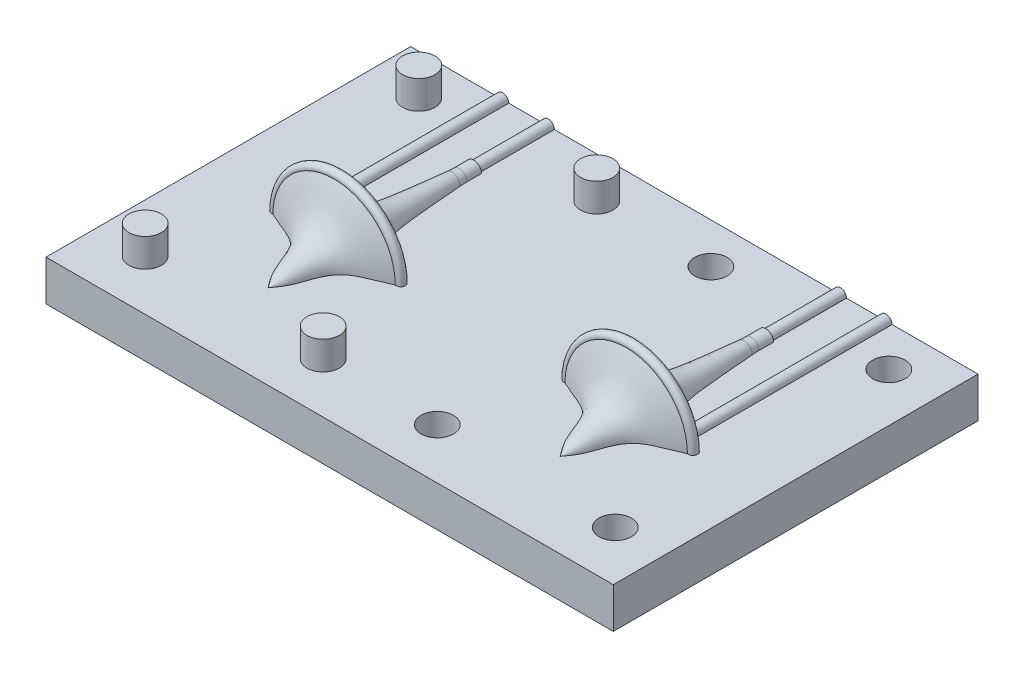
ISO-10303-21;
HEADER;
FILE_DESCRIPTION(('STEP AP214'),'2;1');
FILE_NAME('part.step','',(''),(''),'','','');
FILE_SCHEMA(('AUTOMOTIVE_DESIGN { 1 0 10303 214 1 1 1 1 }'));
ENDSEC;
DATA;
#1=APPLICATION_CONTEXT('core data for automotive mechanical design processes');
#2=APPLICATION_PROTOCOL_DEFINITION('international standard','automotive_design',2000,#1);
#3=PRODUCT_CONTEXT('',#1,'mechanical');
#4=PRODUCT('Part','Part','',(#3));
#5=PRODUCT_RELATED_PRODUCT_CATEGORY('part','',(#4));
#6=PRODUCT_DEFINITION_FORMATION('','',#4);
#7=PRODUCT_DEFINITION_CONTEXT('part definition',#1,'design');
#8=PRODUCT_DEFINITION('design','',#6,#7);
#9=PRODUCT_DEFINITION_SHAPE('','',#8);
#10=(LENGTH_UNIT() NAMED_UNIT(*) SI_UNIT(.MILLI.,.METRE.));
#11=(NAMED_UNIT(*) PLANE_ANGLE_UNIT() SI_UNIT($,.RADIAN.));
#12=(NAMED_UNIT(*) SI_UNIT($,.STERADIAN.) SOLID_ANGLE_UNIT());
#13=UNCERTAINTY_MEASURE_WITH_UNIT(LENGTH_MEASURE(1.E-05),#10,'distance_accuracy_value','');
#14=(GEOMETRIC_REPRESENTATION_CONTEXT(3) GLOBAL_UNCERTAINTY_ASSIGNED_CONTEXT((#13)) GLOBAL_UNIT_ASSIGNED_CONTEXT((#10,
#11,#12)) REPRESENTATION_CONTEXT('',''));
#15=CARTESIAN_POINT('',(0.,0.,0.));
#16=DIRECTION('',(0.,0.,1.));
#17=DIRECTION('',(1.,0.,0.));
#18=AXIS2_PLACEMENT_3D('',#15,#16,#17);
#19=CARTESIAN_POINT('',(0.,0.,0.));
#20=DIRECTION('',(0.,1.,0.));
#21=DIRECTION('',(0.,0.,1.));
#22=AXIS2_PLACEMENT_3D('',#19,#20,#21);
#23=PLANE('',#22);
#24=CARTESIAN_POINT('',(36.7814315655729,-1.05520616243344E-13,6.45827597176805));
#25=CARTESIAN_POINT('',(24.755098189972,0.,2.45774370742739));
#26=CARTESIAN_POINT('',(25.6676785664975,0.,2.40279251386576));
#27=CARTESIAN_POINT('',(23.6545891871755,0.,-20.4964687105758));
#28=B_SPLINE_CURVE_WITH_KNOTS('',3,(#24,#25,#26,#27),.UNSPECIFIED.,.F.,.F.,(4,4),(0.,1.),.UNSPECIFIED.);
#29=CARTESIAN_POINT('',(31.426362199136,0.,4.51387207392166));
#30=VERTEX_POINT('',#29);
#31=CARTESIAN_POINT('',(23.6545891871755,0.,-20.4964687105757));
#32=VERTEX_POINT('',#31);
#33=EDGE_CURVE('E204',#30,#32,#28,.T.);
#34=ORIENTED_EDGE('',*,*,#33,.F.);
#35=DIRECTION('',(0.,0.,1.));
#36=VECTOR('',#35,1.);
#37=CARTESIAN_POINT('',(31.4263621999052,0.,5.66200099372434));
#38=LINE('',#37,#36);
#39=CARTESIAN_POINT('',(31.4263621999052,0.,-44.2476631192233));
#40=VERTEX_POINT('',#39);
#41=EDGE_CURVE('E55',#40,#30,#38,.T.);
#42=ORIENTED_EDGE('',*,*,#41,.F.);
#43=DIRECTION('',(-1.,0.,0.));
#44=VECTOR('',#43,1.);
#45=CARTESIAN_POINT('',(-84.3695700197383,0.,-44.2476631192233));
#46=LINE('',#45,#44);
#47=CARTESIAN_POINT('',(23.1702787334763,0.,-44.2476631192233));
#48=VERTEX_POINT('',#47);
#49=EDGE_CURVE('E418',#40,#48,#46,.T.);
#50=ORIENTED_EDGE('',*,*,#49,.T.);
#51=DIRECTION('',(0.,0.,-1.));
#52=VECTOR('',#51,1.);
#53=CARTESIAN_POINT('',(23.1702787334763,0.,-25.8649161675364));
#54=LINE('',#53,#52);
#55=CARTESIAN_POINT('',(23.1702787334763,0.,-25.8649161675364));
#56=VERTEX_POINT('',#55);
#57=EDGE_CURVE('E625',#56,#48,#54,.T.);
#58=ORIENTED_EDGE('',*,*,#57,.F.);
#59=DIRECTION('',(-1.,0.,0.));
#60=VECTOR('',#59,1.);
#61=CARTESIAN_POINT('',(23.5777514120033,0.,-25.8649161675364));
#62=LINE('',#61,#60);
#63=CARTESIAN_POINT('',(23.5777514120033,0.,-25.8649161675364));
#64=VERTEX_POINT('',#63);
#65=EDGE_CURVE('E305',#64,#56,#62,.T.);
#66=ORIENTED_EDGE('',*,*,#65,.F.);
#67=DIRECTION('',(0.,0.,-1.));
#68=VECTOR('',#67,1.);
#69=CARTESIAN_POINT('',(23.5777514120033,0.,-22.2479272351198));
#70=LINE('',#69,#68);
#71=CARTESIAN_POINT('',(23.5777514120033,0.,-22.2479272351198));
#72=VERTEX_POINT('',#71);
#73=EDGE_CURVE('E302',#72,#64,#70,.T.);
#74=ORIENTED_EDGE('',*,*,#73,.F.);
#75=CARTESIAN_POINT('',(43.5777514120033,-1.52979064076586E-13,-22.2479272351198));
#76=DIRECTION('',(0.,-1.,0.));
#77=DIRECTION('',(0.,0.,-1.));
#78=AXIS2_PLACEMENT_3D('',#75,#76,#77);
#79=CIRCLE('',#78,20.);
#80=EDGE_CURVE('E203',#32,#72,#79,.T.);
#81=ORIENTED_EDGE('',*,*,#80,.F.);
#82=EDGE_LOOP('',(#34,#42,#50,#58,#66,#74,#81));
#83=FACE_BOUND('',#82,.T.);
#84=ADVANCED_FACE('F35',(#83),#23,.T.);
#85=CARTESIAN_POINT('',(-0.289872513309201,0.,-34.2476631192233));
#86=DIRECTION('',(0.,1.,0.));
#87=DIRECTION('',(0.,0.,-1.));
#88=AXIS2_PLACEMENT_3D('',#85,#86,#87);
#89=CIRCLE('',#88,4.);
#90=CARTESIAN_POINT('',(-0.289872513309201,0.,-38.2476631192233));
#91=VERTEX_POINT('',#90);
#92=EDGE_CURVE('E613',#91,#91,#89,.T.);
#93=ORIENTED_EDGE('',*,*,#92,.F.);
#94=EDGE_LOOP('',(#93));
#95=FACE_BOUND('',#94,.T.);
#96=CARTESIAN_POINT('',(-0.289872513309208,0.,33.2762317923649));
#97=DIRECTION('',(0.,1.,0.));
#98=DIRECTION('',(0.,0.,-1.));
#99=AXIS2_PLACEMENT_3D('',#96,#97,#98);
#100=CIRCLE('',#99,4.);
#101=CARTESIAN_POINT('',(-0.289872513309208,0.,29.2762317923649));
#102=VERTEX_POINT('',#101);
#103=EDGE_CURVE('E607',#102,#102,#100,.T.);
#104=ORIENTED_EDGE('',*,*,#103,.F.);
#105=EDGE_LOOP('',(#104));
#106=FACE_BOUND('',#105,.T.);
#107=CARTESIAN_POINT('',(43.6304299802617,0.,33.2762317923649));
#108=DIRECTION('',(0.,1.,0.));
#109=DIRECTION('',(0.,0.,-1.));
#110=AXIS2_PLACEMENT_3D('',#107,#108,#109);
#111=CIRCLE('',#110,4.00000000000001);
#112=CARTESIAN_POINT('',(43.6304299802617,0.,29.2762317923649));
#113=VERTEX_POINT('',#112);
#114=EDGE_CURVE('E600',#113,#113,#111,.T.);
#115=ORIENTED_EDGE('',*,*,#114,.F.);
#116=EDGE_LOOP('',(#115));
#117=FACE_BOUND('',#116,.T.);
#118=CARTESIAN_POINT('',(43.6304299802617,0.,-34.2476631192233));
#119=DIRECTION('',(0.,1.,0.));
#120=DIRECTION('',(0.,0.,-1.));
#121=AXIS2_PLACEMENT_3D('',#118,#119,#120);
#122=CIRCLE('',#121,4.00000000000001);
#123=CARTESIAN_POINT('',(43.6304299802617,0.,-38.2476631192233));
#124=VERTEX_POINT('',#123);
#125=EDGE_CURVE('E591',#124,#124,#122,.T.);
#126=ORIENTED_EDGE('',*,*,#125,.F.);
#127=EDGE_LOOP('',(#126));
#128=FACE_BOUND('',#127,.T.);
#129=CARTESIAN_POINT('',(-28.4492675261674,0.,33.2762317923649));
#130=DIRECTION('',(0.,1.,0.));
#131=DIRECTION('',(0.,0.,1.));
#132=AXIS2_PLACEMENT_3D('',#129,#130,#131);
#133=CIRCLE('',#132,4.);
#134=CARTESIAN_POINT('',(-28.4492675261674,0.,37.276231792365));
#135=VERTEX_POINT('',#134);
#136=EDGE_CURVE('E551',#135,#135,#133,.T.);
#137=ORIENTED_EDGE('',*,*,#136,.F.);
#138=EDGE_LOOP('',(#137));
#139=FACE_BOUND('',#138,.T.);
#140=CARTESIAN_POINT('',(-72.3695700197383,0.,33.276231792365));
#141=DIRECTION('',(0.,1.,0.));
#142=DIRECTION('',(0.,0.,1.));
#143=AXIS2_PLACEMENT_3D('',#140,#141,#142);
#144=CIRCLE('',#143,4.00000000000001);
#145=CARTESIAN_POINT('',(-72.3695700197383,0.,37.276231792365));
#146=VERTEX_POINT('',#145);
#147=EDGE_CURVE('E545',#146,#146,#144,.T.);
#148=ORIENTED_EDGE('',*,*,#147,.F.);
#149=EDGE_LOOP('',(#148));
#150=FACE_BOUND('',#149,.T.);
#151=CARTESIAN_POINT('',(-28.4492675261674,0.,-34.2476631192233));
#152=DIRECTION('',(0.,1.,0.));
#153=DIRECTION('',(0.,0.,1.));
#154=AXIS2_PLACEMENT_3D('',#151,#152,#153);
#155=CIRCLE('',#154,4.);
#156=CARTESIAN_POINT('',(-28.4492675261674,0.,-30.2476631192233));
#157=VERTEX_POINT('',#156);
#158=EDGE_CURVE('E539',#157,#157,#155,.T.);
#159=ORIENTED_EDGE('',*,*,#158,.F.);
#160=EDGE_LOOP('',(#159));
#161=FACE_BOUND('',#160,.T.);
#162=CARTESIAN_POINT('',(-72.3695700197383,0.,-34.2476631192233));
#163=DIRECTION('',(0.,1.,0.));
#164=DIRECTION('',(0.,0.,1.));
#165=AXIS2_PLACEMENT_3D('',#162,#163,#164);
#166=CIRCLE('',#165,4.00000000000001);
#167=CARTESIAN_POINT('',(-72.3695700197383,0.,-30.2476631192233));
#168=VERTEX_POINT('',#167);
#169=EDGE_CURVE('E408',#168,#168,#166,.T.);
#170=ORIENTED_EDGE('',*,*,#169,.F.);
#171=EDGE_LOOP('',(#170));
#172=FACE_BOUND('',#171,.T.);
#173=CARTESIAN_POINT('',(55.6304299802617,0.,-44.2476631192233));
#174=VERTEX_POINT('',#173);
#175=CARTESIAN_POINT('',(34.4263621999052,0.,-44.2476631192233));
#176=VERTEX_POINT('',#175);
#177=EDGE_CURVE('E63',#174,#176,#46,.T.);
#178=ORIENTED_EDGE('',*,*,#177,.T.);
#179=DIRECTION('',(0.,0.,1.));
#180=VECTOR('',#179,1.);
#181=CARTESIAN_POINT('',(34.4263621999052,0.,5.66200099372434));
#182=LINE('',#181,#180);
#183=CARTESIAN_POINT('',(34.4263621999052,0.,5.66200099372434));
#184=VERTEX_POINT('',#183);
#185=EDGE_CURVE('E206',#176,#184,#182,.T.);
#186=ORIENTED_EDGE('',*,*,#185,.T.);
#187=CARTESIAN_POINT('',(36.7814315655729,-1.05520616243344E-13,6.45827597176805));
#188=VERTEX_POINT('',#187);
#189=EDGE_CURVE('E198',#188,#184,#28,.T.);
#190=ORIENTED_EDGE('',*,*,#189,.F.);
#191=CARTESIAN_POINT('',(37.0640182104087,-1.07493908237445E-13,7.53576640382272));
#192=DIRECTION('',(0.,1.,0.));
#193=DIRECTION('',(0.,0.,-1.));
#194=AXIS2_PLACEMENT_3D('',#191,#192,#193);
#195=CIRCLE('',#194,1.11393035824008);
#196=CARTESIAN_POINT('',(36.7814315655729,-1.05520616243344E-13,8.61325683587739));
#197=VERTEX_POINT('',#196);
#198=EDGE_CURVE('E312',#197,#188,#195,.T.);
#199=ORIENTED_EDGE('',*,*,#198,.F.);
#200=CARTESIAN_POINT('',(21.6702787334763,0.,24.8934848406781));
#201=CARTESIAN_POINT('',(25.3778381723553,0.,20.0177586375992));
#202=CARTESIAN_POINT('',(24.303276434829,0.,20.0888211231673));
#203=CARTESIAN_POINT('',(26.4810163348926,0.,10.6163736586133));
#204=CARTESIAN_POINT('',(28.1140289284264,0.,12.7177981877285));
#205=CARTESIAN_POINT('',(36.7814315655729,-1.05520616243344E-13,8.61325683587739));
#206=B_SPLINE_CURVE_WITH_KNOTS('',5,(#200,#201,#202,#203,#204,#205),.UNSPECIFIED.,.F.,.F.,(6,6),
(0.,1.),.UNSPECIFIED.);
#207=CARTESIAN_POINT('',(21.6702787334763,0.,24.8934848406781));
#208=VERTEX_POINT('',#207);
#209=EDGE_CURVE('E307',#208,#197,#206,.T.);
#210=ORIENTED_EDGE('',*,*,#209,.F.);
#211=CARTESIAN_POINT('',(21.6702787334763,0.,24.8934848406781));
#212=CARTESIAN_POINT('',(17.9627192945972,0.,20.0177586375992));
#213=CARTESIAN_POINT('',(19.0372810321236,0.,20.0888211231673));
#214=CARTESIAN_POINT('',(16.8595411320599,0.,10.6163736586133));
#215=CARTESIAN_POINT('',(15.2265285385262,0.,12.7177981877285));
#216=CARTESIAN_POINT('',(6.55912590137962,0.,8.61325683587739));
#217=B_SPLINE_CURVE_WITH_KNOTS('',5,(#211,#212,#213,#214,#215,#216),.UNSPECIFIED.,.F.,.F.,(6,6),
(0.,1.),.UNSPECIFIED.);
#218=CARTESIAN_POINT('',(6.55912590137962,0.,8.61325683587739));
#219=VERTEX_POINT('',#218);
#220=EDGE_CURVE('E572',#208,#219,#217,.T.);
#221=ORIENTED_EDGE('',*,*,#220,.T.);
#222=CARTESIAN_POINT('',(6.2765392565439,0.,7.53576640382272));
#223=DIRECTION('',(0.,-1.,0.));
#224=DIRECTION('',(0.,0.,-1.));
#225=AXIS2_PLACEMENT_3D('',#222,#223,#224);
#226=CIRCLE('',#225,1.11393035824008);
#227=CARTESIAN_POINT('',(6.55912590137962,0.,6.45827597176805));
#228=VERTEX_POINT('',#227);
#229=EDGE_CURVE('E296',#219,#228,#226,.T.);
#230=ORIENTED_EDGE('',*,*,#229,.T.);
#231=CARTESIAN_POINT('',(6.55912590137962,0.,6.45827597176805));
#232=CARTESIAN_POINT('',(18.5854592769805,0.,2.45774370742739));
#233=CARTESIAN_POINT('',(17.6728789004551,0.,2.40279251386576));
#234=CARTESIAN_POINT('',(19.685968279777,0.,-20.4964687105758));
#235=B_SPLINE_CURVE_WITH_KNOTS('',3,(#231,#232,#233,#234),.UNSPECIFIED.,.F.,.F.,(4,4),(0.,1.),.UNSPECIFIED.);
#236=CARTESIAN_POINT('',(19.685968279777,0.,-20.4964687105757));
#237=VERTEX_POINT('',#236);
#238=EDGE_CURVE('E585',#228,#237,#235,.T.);
#239=ORIENTED_EDGE('',*,*,#238,.T.);
#240=CARTESIAN_POINT('',(-0.237193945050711,0.,-22.2479272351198));
#241=DIRECTION('',(0.,1.,0.));
#242=DIRECTION('',(0.,0.,-1.));
#243=AXIS2_PLACEMENT_3D('',#240,#241,#242);
#244=CIRCLE('',#243,20.);
#245=CARTESIAN_POINT('',(19.7628060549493,0.,-22.2479272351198));
#246=VERTEX_POINT('',#245);
#247=EDGE_CURVE('E575',#237,#246,#244,.T.);
#248=ORIENTED_EDGE('',*,*,#247,.T.);
#249=DIRECTION('',(0.,0.,-1.));
#250=VECTOR('',#249,1.);
#251=CARTESIAN_POINT('',(19.7628060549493,0.,-22.2479272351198));
#252=LINE('',#251,#250);
#253=CARTESIAN_POINT('',(19.7628060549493,0.,-25.8649161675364));
#254=VERTEX_POINT('',#253);
#255=EDGE_CURVE('E573',#246,#254,#252,.T.);
#256=ORIENTED_EDGE('',*,*,#255,.T.);
#257=CARTESIAN_POINT('',(20.1702787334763,0.,-25.8649161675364));
#258=VERTEX_POINT('',#257);
#259=EDGE_CURVE('E304',#258,#254,#62,.T.);
#260=ORIENTED_EDGE('',*,*,#259,.F.);
#261=DIRECTION('',(0.,0.,-1.));
#262=VECTOR('',#261,1.);
#263=CARTESIAN_POINT('',(20.1702787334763,0.,-25.8649161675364));
#264=LINE('',#263,#262);
#265=CARTESIAN_POINT('',(20.1702787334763,0.,-44.2476631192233));
#266=VERTEX_POINT('',#265);
#267=EDGE_CURVE('E623',#258,#266,#264,.T.);
#268=ORIENTED_EDGE('',*,*,#267,.T.);
#269=CARTESIAN_POINT('',(-48.9094187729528,0.,-44.2476631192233));
#270=VERTEX_POINT('',#269);
#271=EDGE_CURVE('E419',#266,#270,#46,.T.);
#272=ORIENTED_EDGE('',*,*,#271,.T.);
#273=DIRECTION('',(0.,0.,-1.));
#274=VECTOR('',#273,1.);
#275=CARTESIAN_POINT('',(-48.9094187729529,0.,-25.8649161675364));
#276=LINE('',#275,#274);
#277=CARTESIAN_POINT('',(-48.9094187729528,0.,-25.8649161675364));
#278=VERTEX_POINT('',#277);
#279=EDGE_CURVE('E631',#278,#270,#276,.T.);
#280=ORIENTED_EDGE('',*,*,#279,.F.);
#281=DIRECTION('',(1.,0.,0.));
#282=VECTOR('',#281,1.);
#283=CARTESIAN_POINT('',(-52.3168914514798,0.,-25.8649161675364));
#284=LINE('',#283,#282);
#285=CARTESIAN_POINT('',(-48.5019460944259,0.,-25.8649161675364));
#286=VERTEX_POINT('',#285);
#287=EDGE_CURVE('E466',#278,#286,#284,.T.);
#288=ORIENTED_EDGE('',*,*,#287,.T.);
#289=DIRECTION('',(0.,0.,-1.));
#290=VECTOR('',#289,1.);
#291=CARTESIAN_POINT('',(-48.5019460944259,0.,-22.2479272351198));
#292=LINE('',#291,#290);
#293=CARTESIAN_POINT('',(-48.5019460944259,0.,-22.2479272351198));
#294=VERTEX_POINT('',#293);
#295=EDGE_CURVE('E437',#294,#286,#292,.T.);
#296=ORIENTED_EDGE('',*,*,#295,.F.);
#297=CARTESIAN_POINT('',(-28.5019460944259,0.,-22.2479272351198));
#298=DIRECTION('',(0.,-1.,0.));
#299=DIRECTION('',(0.,0.,-1.));
#300=AXIS2_PLACEMENT_3D('',#297,#298,#299);
#301=CIRCLE('',#300,20.);
#302=CARTESIAN_POINT('',(-48.4251083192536,0.,-20.4964687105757));
#303=VERTEX_POINT('',#302);
#304=EDGE_CURVE('E431',#303,#294,#301,.T.);
#305=ORIENTED_EDGE('',*,*,#304,.F.);
#306=CARTESIAN_POINT('',(-35.2982659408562,0.,6.45827597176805));
#307=CARTESIAN_POINT('',(-47.3245993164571,0.,2.45774370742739));
#308=CARTESIAN_POINT('',(-46.4120189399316,0.,2.40279251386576));
#309=CARTESIAN_POINT('',(-48.4251083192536,0.,-20.4964687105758));
#310=B_SPLINE_CURVE_WITH_KNOTS('',3,(#306,#307,#308,#309),.UNSPECIFIED.,.F.,.F.,(4,4),(0.,1.),.UNSPECIFIED.);
#311=CARTESIAN_POINT('',(-35.2982659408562,0.,6.45827597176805));
#312=VERTEX_POINT('',#311);
#313=EDGE_CURVE('E421',#312,#303,#310,.T.);
#314=ORIENTED_EDGE('',*,*,#313,.F.);
#315=CARTESIAN_POINT('',(-35.0156792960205,0.,7.53576640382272));
#316=DIRECTION('',(0.,1.,0.));
#317=DIRECTION('',(0.,0.,-1.));
#318=AXIS2_PLACEMENT_3D('',#315,#316,#317);
#319=CIRCLE('',#318,1.11393035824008);
#320=CARTESIAN_POINT('',(-35.2982659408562,0.,8.61325683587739));
#321=VERTEX_POINT('',#320);
#322=EDGE_CURVE('E445',#321,#312,#319,.T.);
#323=ORIENTED_EDGE('',*,*,#322,.F.);
#324=CARTESIAN_POINT('',(-50.4094187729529,0.,24.8934848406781));
#325=CARTESIAN_POINT('',(-46.7018593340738,0.,20.0177586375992));
#326=CARTESIAN_POINT('',(-47.7764210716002,0.,20.0888211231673));
#327=CARTESIAN_POINT('',(-45.5986811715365,0.,10.6163736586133));
#328=CARTESIAN_POINT('',(-43.9656685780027,0.,12.7177981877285));
#329=CARTESIAN_POINT('',(-35.2982659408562,0.,8.61325683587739));
#330=B_SPLINE_CURVE_WITH_KNOTS('',5,(#324,#325,#326,#327,#328,#329),.UNSPECIFIED.,.F.,.F.,(6,6),
(0.,1.),.UNSPECIFIED.);
#331=CARTESIAN_POINT('',(-50.4094187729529,0.,24.8934848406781));
#332=VERTEX_POINT('',#331);
#333=EDGE_CURVE('E440',#332,#321,#330,.T.);
#334=ORIENTED_EDGE('',*,*,#333,.F.);
#335=CARTESIAN_POINT('',(-50.4094187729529,0.,24.8934848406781));
#336=CARTESIAN_POINT('',(-54.1169782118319,0.,20.0177586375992));
#337=CARTESIAN_POINT('',(-53.0424164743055,0.,20.0888211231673));
#338=CARTESIAN_POINT('',(-55.2201563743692,0.,10.6163736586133));
#339=CARTESIAN_POINT('',(-56.853168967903,0.,12.7177981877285));
#340=CARTESIAN_POINT('',(-65.5205716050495,-1.05520616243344E-13,8.61325683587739));
#341=B_SPLINE_CURVE_WITH_KNOTS('',5,(#335,#336,#337,#338,#339,#340),.UNSPECIFIED.,.F.,.F.,(6,6),
(0.,1.),.UNSPECIFIED.);
#342=CARTESIAN_POINT('',(-65.5205716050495,-1.05520616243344E-13,8.61325683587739));
#343=VERTEX_POINT('',#342);
#344=EDGE_CURVE('E470',#332,#343,#341,.T.);
#345=ORIENTED_EDGE('',*,*,#344,.T.);
#346=CARTESIAN_POINT('',(-65.8031582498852,-1.07493908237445E-13,7.53576640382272));
#347=DIRECTION('',(0.,-1.,0.));
#348=DIRECTION('',(0.,0.,-1.));
#349=AXIS2_PLACEMENT_3D('',#346,#347,#348);
#350=CIRCLE('',#349,1.11393035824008);
#351=CARTESIAN_POINT('',(-65.5205716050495,0.,6.45827597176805));
#352=VERTEX_POINT('',#351);
#353=EDGE_CURVE('E476',#343,#352,#350,.T.);
#354=ORIENTED_EDGE('',*,*,#353,.T.);
#355=CARTESIAN_POINT('',(-65.5205716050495,-1.05520616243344E-13,6.45827597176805));
#356=CARTESIAN_POINT('',(-53.4942382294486,0.,2.45774370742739));
#357=CARTESIAN_POINT('',(-54.4068186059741,0.,2.40279251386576));
#358=CARTESIAN_POINT('',(-52.3937292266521,0.,-20.4964687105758));
#359=B_SPLINE_CURVE_WITH_KNOTS('',3,(#355,#356,#357,#358),.UNSPECIFIED.,.F.,.F.,(4,4),(0.,1.),.UNSPECIFIED.);
#360=CARTESIAN_POINT('',(-63.1655022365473,0.,5.66200099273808));
#361=VERTEX_POINT('',#360);
#362=EDGE_CURVE('E451',#352,#361,#359,.T.);
#363=ORIENTED_EDGE('',*,*,#362,.T.);
#364=DIRECTION('',(0.,0.,1.));
#365=VECTOR('',#364,1.);
#366=CARTESIAN_POINT('',(-63.1655022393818,0.,5.66200099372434));
#367=LINE('',#366,#365);
#368=CARTESIAN_POINT('',(-63.1655022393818,0.,-44.2476631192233));
#369=VERTEX_POINT('',#368);
#370=EDGE_CURVE('E215',#369,#361,#367,.T.);
#371=ORIENTED_EDGE('',*,*,#370,.F.);
#372=CARTESIAN_POINT('',(-84.3695700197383,0.,-44.2476631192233));
#373=VERTEX_POINT('',#372);
#374=EDGE_CURVE('E415',#369,#373,#46,.T.);
#375=ORIENTED_EDGE('',*,*,#374,.T.);
#376=DIRECTION('',(0.,0.,1.));
#377=VECTOR('',#376,1.);
#378=CARTESIAN_POINT('',(-84.3695700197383,0.,-44.2476631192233));
#379=LINE('',#378,#377);
#380=CARTESIAN_POINT('',(-84.3695700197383,0.,45.7523368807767));
#381=VERTEX_POINT('',#380);
#382=EDGE_CURVE('E394',#373,#381,#379,.T.);
#383=ORIENTED_EDGE('',*,*,#382,.T.);
#384=DIRECTION('',(1.,0.,0.));
#385=VECTOR('',#384,1.);
#386=CARTESIAN_POINT('',(-84.3695700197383,0.,45.7523368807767));
#387=LINE('',#386,#385);
#388=CARTESIAN_POINT('',(55.6304299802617,0.,45.7523368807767));
#389=VERTEX_POINT('',#388);
#390=EDGE_CURVE('E402',#381,#389,#387,.T.);
#391=ORIENTED_EDGE('',*,*,#390,.T.);
#392=DIRECTION('',(0.,0.,-1.));
#393=VECTOR('',#392,1.);
#394=CARTESIAN_POINT('',(55.6304299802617,0.,-44.2476631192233));
#395=LINE('',#394,#393);
#396=EDGE_CURVE('E405',#389,#174,#395,.T.);
#397=ORIENTED_EDGE('',*,*,#396,.T.);
#398=EDGE_LOOP('',(#178,#186,#190,#199,#210,#221,#230,#239,#248,#256,#260,#268,#272,#280,#288,
#296,#305,#314,#323,#334,#345,#354,#363,#371,#375,#383,#391,#397));
#399=FACE_BOUND('',#398,.T.);
#400=ADVANCED_FACE('F207',(#95,#106,#117,#128,#139,#150,#161,#172,#399),#23,.T.);
#401=CARTESIAN_POINT('',(21.6702787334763,0.,33.848795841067));
#402=DIRECTION('',(0.,0.,-1.));
#403=AXIS1_PLACEMENT('',#401,#402);
#404=SURFACE_OF_REVOLUTION('',#28,#403);
#405=CARTESIAN_POINT('',(31.4263621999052,0.,4.51387207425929));
#406=CARTESIAN_POINT('',(31.4263559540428,0.0392249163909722,4.51386692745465));
#407=CARTESIAN_POINT('',(31.4279006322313,0.0784458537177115,4.51465111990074));
#408=CARTESIAN_POINT('',(31.4340436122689,0.156573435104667,4.5177592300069));
#409=CARTESIAN_POINT('',(31.4386408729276,0.195480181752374,4.52008262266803));
#410=CARTESIAN_POINT('',(31.450816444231,0.272545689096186,4.52621792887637));
#411=CARTESIAN_POINT('',(31.4583827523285,0.310706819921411,4.53002384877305));
#412=CARTESIAN_POINT('',(31.4764015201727,0.386161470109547,4.5390494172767));
#413=CARTESIAN_POINT('',(31.4868541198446,0.423454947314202,4.54426913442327));
#414=CARTESIAN_POINT('',(31.5223605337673,0.533582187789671,4.56190855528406));
#415=CARTESIAN_POINT('',(31.5515859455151,0.604805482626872,4.57632034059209));
#416=CARTESIAN_POINT('',(31.6200180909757,0.741149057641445,4.60956231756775));
#417=CARTESIAN_POINT('',(31.6592330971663,0.806264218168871,4.62839617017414));
#418=CARTESIAN_POINT('',(31.7486181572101,0.932301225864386,4.67057847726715));
#419=CARTESIAN_POINT('',(31.7992471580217,0.992836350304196,4.69410902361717));
#420=CARTESIAN_POINT('',(31.9086392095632,1.1047026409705,4.74393273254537));
#421=CARTESIAN_POINT('',(31.9674048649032,1.1560308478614,4.77022677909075));
#422=CARTESIAN_POINT('',(32.0975549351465,1.25310840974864,4.82724641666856));
#423=CARTESIAN_POINT('',(32.1696087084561,1.29785436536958,4.85815531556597));
#424=CARTESIAN_POINT('',(32.3198063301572,1.37448311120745,4.92110545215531));
#425=CARTESIAN_POINT('',(32.3979520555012,1.40636191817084,4.95314703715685));
#426=CARTESIAN_POINT('',(32.5632617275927,1.45811608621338,5.01941623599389));
#427=CARTESIAN_POINT('',(32.6506852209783,1.47714773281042,5.05365873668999));
#428=CARTESIAN_POINT('',(32.8277861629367,1.49941650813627,5.12148306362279));
#429=CARTESIAN_POINT('',(32.9174639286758,1.50265140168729,5.15506479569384));
#430=CARTESIAN_POINT('',(33.0973522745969,1.49296654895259,5.22105658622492));
#431=CARTESIAN_POINT('',(33.1875600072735,1.47989562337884,5.25345277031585));
#432=CARTESIAN_POINT('',(33.3648633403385,1.43736702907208,5.31596372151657));
#433=CARTESIAN_POINT('',(33.4519593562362,1.407911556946,5.34607879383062));
#434=CARTESIAN_POINT('',(33.6175358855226,1.33425485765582,5.40242766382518));
#435=CARTESIAN_POINT('',(33.6961988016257,1.29053405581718,5.42875222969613));
#436=CARTESIAN_POINT('',(33.8451404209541,1.18909897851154,5.47795765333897));
#437=CARTESIAN_POINT('',(33.9154218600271,1.13138928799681,5.50083963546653));
#438=CARTESIAN_POINT('',(34.0417268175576,1.00669836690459,5.54154214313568));
#439=CARTESIAN_POINT('',(34.0982878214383,0.940325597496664,5.5595586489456));
#440=CARTESIAN_POINT('',(34.1994113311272,0.798092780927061,5.59153356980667));
#441=CARTESIAN_POINT('',(34.2439738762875,0.722232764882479,5.60549199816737));
#442=CARTESIAN_POINT('',(34.317503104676,0.567215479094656,5.62841052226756));
#443=CARTESIAN_POINT('',(34.3471224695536,0.488397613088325,5.6375805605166));
#444=CARTESIAN_POINT('',(34.3927682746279,0.326630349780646,5.65167718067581));
#445=CARTESIAN_POINT('',(34.4088187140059,0.243688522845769,5.65661125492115));
#446=CARTESIAN_POINT('',(34.4206554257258,0.133447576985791,5.66024834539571));
#447=CARTESIAN_POINT('',(34.4227962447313,0.106784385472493,5.66090593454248));
#448=CARTESIAN_POINT('',(34.4256476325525,0.0534180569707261,5.66178164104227));
#449=CARTESIAN_POINT('',(34.426360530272,0.026715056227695,5.66200047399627));
#450=CARTESIAN_POINT('',(34.4263621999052,0.,5.66200099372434));
#451=B_SPLINE_CURVE_WITH_KNOTS('',3,(#405,#406,#407,#408,#409,#410,#411,#412,#413,#414,#415,
#416,#417,#418,#419,#420,#421,#422,#423,#424,#425,#426,#427,#428,#429,#430,#431,#432,#433,#434,
#435,#436,#437,#438,#439,#440,#441,#442,#443,#444,#445,#446,#447,#448,#449,#450),.UNSPECIFIED.,
.F.,.F.,(4,2,2,2,2,2,2,2,2,2,2,2,2,2,2,2,2,2,2,2,2,2,4),(0.,0.117629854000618,0.235219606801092,
0.352338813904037,0.469463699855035,0.703283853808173,0.937298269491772,1.18332284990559,
1.4294263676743,1.69907263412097,1.96880231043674,2.25486460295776,2.54096737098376,
2.82974256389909,3.11847905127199,3.39835186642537,3.67813307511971,3.94391388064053,
4.20969381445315,4.46255736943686,4.7149727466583,4.79521440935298,4.87532509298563),.UNSPECIFIED.);
#452=EDGE_CURVE('E11',#30,#184,#451,.T.);
#453=ORIENTED_EDGE('',*,*,#452,.F.);
#454=ORIENTED_EDGE('',*,*,#33,.T.);
#455=CARTESIAN_POINT('',(21.6702787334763,0.,-20.4964687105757));
#456=DIRECTION('',(0.,0.,1.));
#457=DIRECTION('',(1.,0.,0.));
#458=AXIS2_PLACEMENT_3D('',#455,#456,#457);
#459=CIRCLE('',#458,1.98431045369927);
#460=EDGE_CURVE('E554',#32,#237,#459,.T.);
#461=ORIENTED_EDGE('',*,*,#460,.T.);
#462=ORIENTED_EDGE('',*,*,#238,.F.);
#463=CARTESIAN_POINT('',(21.6702787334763,0.,6.45827597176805));
#464=DIRECTION('',(0.,0.,1.));
#465=DIRECTION('',(1.,0.,0.));
#466=AXIS2_PLACEMENT_3D('',#463,#464,#465);
#467=CIRCLE('',#466,15.1111528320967);
#468=EDGE_CURVE('E201',#188,#228,#467,.T.);
#469=ORIENTED_EDGE('',*,*,#468,.F.);
#470=ORIENTED_EDGE('',*,*,#189,.T.);
#471=EDGE_LOOP('',(#453,#454,#461,#462,#469,#470));
#472=FACE_BOUND('',#471,.T.);
#473=ADVANCED_FACE('F199',(#472),#404,.T.);
#474=CARTESIAN_POINT('',(-51.9094187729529,0.,-44.2476631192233));
#475=VERTEX_POINT('',#474);
#476=CARTESIAN_POINT('',(-60.1655022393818,0.,-44.2476631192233));
#477=VERTEX_POINT('',#476);
#478=EDGE_CURVE('E525',#475,#477,#46,.T.);
#479=ORIENTED_EDGE('',*,*,#478,.T.);
#480=DIRECTION('',(0.,0.,1.));
#481=VECTOR('',#480,1.);
#482=CARTESIAN_POINT('',(-60.1655022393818,0.,5.66200099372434));
#483=LINE('',#482,#481);
#484=CARTESIAN_POINT('',(-60.1655022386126,0.,4.51387207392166));
#485=VERTEX_POINT('',#484);
#486=EDGE_CURVE('E220',#477,#485,#483,.T.);
#487=ORIENTED_EDGE('',*,*,#486,.T.);
#488=CARTESIAN_POINT('',(-52.3937292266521,0.,-20.4964687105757));
#489=VERTEX_POINT('',#488);
#490=EDGE_CURVE('E450',#485,#489,#359,.T.);
#491=ORIENTED_EDGE('',*,*,#490,.T.);
#492=CARTESIAN_POINT('',(-72.3168914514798,-1.52979064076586E-13,-22.2479272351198));
#493=DIRECTION('',(0.,1.,0.));
#494=DIRECTION('',(0.,0.,-1.));
#495=AXIS2_PLACEMENT_3D('',#492,#493,#494);
#496=CIRCLE('',#495,20.);
#497=CARTESIAN_POINT('',(-52.3168914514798,0.,-22.2479272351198));
#498=VERTEX_POINT('',#497);
#499=EDGE_CURVE('E457',#489,#498,#496,.T.);
#500=ORIENTED_EDGE('',*,*,#499,.T.);
#501=DIRECTION('',(0.,0.,-1.));
#502=VECTOR('',#501,1.);
#503=CARTESIAN_POINT('',(-52.3168914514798,0.,-22.2479272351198));
#504=LINE('',#503,#502);
#505=CARTESIAN_POINT('',(-52.3168914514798,0.,-25.8649161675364));
#506=VERTEX_POINT('',#505);
#507=EDGE_CURVE('E463',#498,#506,#504,.T.);
#508=ORIENTED_EDGE('',*,*,#507,.T.);
#509=CARTESIAN_POINT('',(-51.9094187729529,0.,-25.8649161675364));
#510=VERTEX_POINT('',#509);
#511=EDGE_CURVE('E467',#506,#510,#284,.T.);
#512=ORIENTED_EDGE('',*,*,#511,.T.);
#513=DIRECTION('',(0.,0.,-1.));
#514=VECTOR('',#513,1.);
#515=CARTESIAN_POINT('',(-51.9094187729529,0.,-25.8649161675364));
#516=LINE('',#515,#514);
#517=EDGE_CURVE('E233',#510,#475,#516,.T.);
#518=ORIENTED_EDGE('',*,*,#517,.T.);
#519=EDGE_LOOP('',(#479,#487,#491,#500,#508,#512,#518));
#520=FACE_BOUND('',#519,.T.);
#521=ADVANCED_FACE('F289',(#520),#23,.T.);
#522=CARTESIAN_POINT('',(-50.4094187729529,0.,33.848795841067));
#523=DIRECTION('',(0.,0.,-1.));
#524=AXIS1_PLACEMENT('',#522,#523);
#525=SURFACE_OF_REVOLUTION('',#359,#524);
#526=CARTESIAN_POINT('',(-63.1655022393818,0.,5.66200099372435));
#527=CARTESIAN_POINT('',(-63.1655034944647,0.0407969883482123,5.66200095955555));
#528=CARTESIAN_POINT('',(-63.163836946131,0.0815753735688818,5.66148973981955));
#529=CARTESIAN_POINT('',(-63.1571953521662,0.162829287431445,5.65944966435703));
#530=CARTESIAN_POINT('',(-63.1522208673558,0.203304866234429,5.65792098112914));
#531=CARTESIAN_POINT('',(-63.1324105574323,0.323685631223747,5.65182642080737));
#532=CARTESIAN_POINT('',(-63.1126875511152,0.402764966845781,5.64575196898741));
#533=CARTESIAN_POINT('',(-63.0608719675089,0.556339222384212,5.62971292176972));
#534=CARTESIAN_POINT('',(-63.0287781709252,0.630833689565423,5.61974794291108));
#535=CARTESIAN_POINT('',(-62.9722544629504,0.737580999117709,5.60207391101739));
#536=CARTESIAN_POINT('',(-62.9520095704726,0.772339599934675,5.59572609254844));
#537=CARTESIAN_POINT('',(-62.9088692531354,0.840030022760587,5.58214857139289));
#538=CARTESIAN_POINT('',(-62.8859717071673,0.872960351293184,5.57491816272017));
#539=CARTESIAN_POINT('',(-62.8128087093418,0.969681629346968,5.55171765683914));
#540=CARTESIAN_POINT('',(-62.7586658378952,1.03028679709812,5.53442248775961));
#541=CARTESIAN_POINT('',(-62.641906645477,1.14155303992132,5.49671324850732));
#542=CARTESIAN_POINT('',(-62.5792874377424,1.19221071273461,5.47629811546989));
#543=CARTESIAN_POINT('',(-62.4790703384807,1.26089027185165,5.4432044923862));
#544=CARTESIAN_POINT('',(-62.4438411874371,1.28292786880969,5.43149966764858));
#545=CARTESIAN_POINT('',(-62.3718916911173,1.3239057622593,5.40742754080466));
#546=CARTESIAN_POINT('',(-62.3351728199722,1.34284903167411,5.39506088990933));
#547=CARTESIAN_POINT('',(-62.2230916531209,1.39494580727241,5.35702977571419));
#548=CARTESIAN_POINT('',(-62.1457925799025,1.42337459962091,5.33043013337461));
#549=CARTESIAN_POINT('',(-61.9843750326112,1.46822624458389,5.27393149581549));
#550=CARTESIAN_POINT('',(-61.9001084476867,1.48398430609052,5.24393432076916));
#551=CARTESIAN_POINT('',(-61.7306563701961,1.50100208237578,5.18242268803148));
#552=CARTESIAN_POINT('',(-61.6454706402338,1.50225795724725,5.15090783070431));
#553=CARTESIAN_POINT('',(-61.4726607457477,1.49018238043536,5.08562462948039));
#554=CARTESIAN_POINT('',(-61.3850960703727,1.47620128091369,5.05181833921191));
#555=CARTESIAN_POINT('',(-61.2137850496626,1.43309337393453,4.98415280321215));
#556=CARTESIAN_POINT('',(-61.1300394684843,1.40396354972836,4.95029354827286));
#557=CARTESIAN_POINT('',(-60.9669423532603,1.33048183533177,4.88280941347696));
#558=CARTESIAN_POINT('',(-60.8877211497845,1.28582114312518,4.84920462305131));
#559=CARTESIAN_POINT('',(-60.7380163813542,1.18238967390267,4.78423007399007));
#560=CARTESIAN_POINT('',(-60.6675329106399,1.12361874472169,4.7528603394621));
#561=CARTESIAN_POINT('',(-60.5393441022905,0.994892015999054,4.69460315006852));
#562=CARTESIAN_POINT('',(-60.4813610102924,0.925256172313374,4.66762250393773));
#563=CARTESIAN_POINT('',(-60.378245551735,0.775388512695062,4.6188175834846));
#564=CARTESIAN_POINT('',(-60.3331100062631,0.695159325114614,4.59699203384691));
#565=CARTESIAN_POINT('',(-60.2609897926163,0.53342057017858,4.56169585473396));
#566=CARTESIAN_POINT('',(-60.2328189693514,0.452557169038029,4.54768631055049));
#567=CARTESIAN_POINT('',(-60.1906346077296,0.286461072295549,4.52658732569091));
#568=CARTESIAN_POINT('',(-60.176582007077,0.201241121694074,4.51947879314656));
#569=CARTESIAN_POINT('',(-60.1684681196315,0.0962529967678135,4.51537335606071));
#570=CARTESIAN_POINT('',(-60.1673556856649,0.0770106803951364,4.51481040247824));
#571=CARTESIAN_POINT('',(-60.1658739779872,0.0385149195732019,4.51406045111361));
#572=CARTESIAN_POINT('',(-60.1655037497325,0.0192615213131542,4.51387297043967));
#573=CARTESIAN_POINT('',(-60.1655022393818,0.,4.51387207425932));
#574=B_SPLINE_CURVE_WITH_KNOTS('',3,(#526,#527,#528,#529,#530,#531,#532,#533,#534,#535,#536,
#537,#538,#539,#540,#541,#542,#543,#544,#545,#546,#547,#548,#549,#550,#551,#552,#553,#554,#555,
#556,#557,#558,#559,#560,#561,#562,#563,#564,#565,#566,#567,#568,#569,#570,#571,#572,#573),
.UNSPECIFIED.,.F.,.F.,(4,2,2,2,2,2,2,2,2,2,2,2,2,2,2,2,2,2,2,2,2,2,2,4),(0.,0.122317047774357,
0.244613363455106,0.488554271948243,0.732519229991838,0.854566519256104,0.976712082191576,
1.22478783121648,1.4729482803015,1.60233548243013,1.73159763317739,1.99007650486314,
2.26136471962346,2.53272476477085,2.8161238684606,3.09957943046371,3.38902776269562,
3.67847921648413,3.96062063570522,4.24269218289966,4.50160039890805,4.75979027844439,
4.81762857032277,4.87539242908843),.UNSPECIFIED.);
#575=EDGE_CURVE('E225',#361,#485,#574,.T.);
#576=ORIENTED_EDGE('',*,*,#575,.F.);
#577=ORIENTED_EDGE('',*,*,#362,.F.);
#578=CARTESIAN_POINT('',(-50.4094187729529,0.,6.45827597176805));
#579=DIRECTION('',(0.,0.,-1.));
#580=DIRECTION('',(-1.,0.,0.));
#581=AXIS2_PLACEMENT_3D('',#578,#579,#580);
#582=CIRCLE('',#581,15.1111528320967);
#583=EDGE_CURVE('E514',#352,#312,#582,.T.);
#584=ORIENTED_EDGE('',*,*,#583,.T.);
#585=ORIENTED_EDGE('',*,*,#313,.T.);
#586=CARTESIAN_POINT('',(-50.4094187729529,0.,-20.4964687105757));
#587=DIRECTION('',(0.,0.,-1.));
#588=DIRECTION('',(-1.,0.,0.));
#589=AXIS2_PLACEMENT_3D('',#586,#587,#588);
#590=CIRCLE('',#589,1.98431045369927);
#591=EDGE_CURVE('E48',#489,#303,#590,.T.);
#592=ORIENTED_EDGE('',*,*,#591,.F.);
#593=ORIENTED_EDGE('',*,*,#490,.F.);
#594=EDGE_LOOP('',(#576,#577,#584,#585,#592,#593));
#595=FACE_BOUND('',#594,.T.);
#596=ADVANCED_FACE('F235',(#595),#525,.T.);
#597=CARTESIAN_POINT('',(-52.3168914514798,0.,-25.8649161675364));
#598=DIRECTION('',(0.,0.,1.));
#599=DIRECTION('',(1.,0.,0.));
#600=AXIS2_PLACEMENT_3D('',#597,#598,#599);
#601=PLANE('',#600);
#602=CARTESIAN_POINT('',(-50.4094187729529,0.,-25.8649161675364));
#603=DIRECTION('',(0.,0.,1.));
#604=DIRECTION('',(1.,0.,0.));
#605=AXIS2_PLACEMENT_3D('',#602,#603,#604);
#606=CIRCLE('',#605,1.5);
#607=EDGE_CURVE('E504',#278,#510,#606,.T.);
#608=ORIENTED_EDGE('',*,*,#607,.T.);
#609=ORIENTED_EDGE('',*,*,#511,.F.);
#610=CARTESIAN_POINT('',(-50.4094187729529,0.,-25.8649161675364));
#611=DIRECTION('',(0.,0.,-1.));
#612=DIRECTION('',(-1.,0.,0.));
#613=AXIS2_PLACEMENT_3D('',#610,#611,#612);
#614=CIRCLE('',#613,1.90747267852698);
#615=EDGE_CURVE('E496',#506,#286,#614,.T.);
#616=ORIENTED_EDGE('',*,*,#615,.T.);
#617=ORIENTED_EDGE('',*,*,#287,.F.);
#618=EDGE_LOOP('',(#608,#609,#616,#617));
#619=FACE_BOUND('',#618,.T.);
#620=ADVANCED_FACE('F325',(#619),#601,.F.);
#621=CARTESIAN_POINT('',(23.5777514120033,0.,-25.8649161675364));
#622=DIRECTION('',(0.,0.,1.));
#623=DIRECTION('',(-1.,0.,0.));
#624=AXIS2_PLACEMENT_3D('',#621,#622,#623);
#625=PLANE('',#624);
#626=CARTESIAN_POINT('',(21.6702787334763,0.,-25.8649161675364));
#627=DIRECTION('',(0.,0.,-1.));
#628=DIRECTION('',(-1.,0.,0.));
#629=AXIS2_PLACEMENT_3D('',#626,#627,#628);
#630=CIRCLE('',#629,1.5);
#631=EDGE_CURVE('E620',#258,#56,#630,.T.);
#632=ORIENTED_EDGE('',*,*,#631,.F.);
#633=ORIENTED_EDGE('',*,*,#259,.T.);
#634=CARTESIAN_POINT('',(21.6702787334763,0.,-25.8649161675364));
#635=DIRECTION('',(0.,0.,1.));
#636=DIRECTION('',(1.,0.,0.));
#637=AXIS2_PLACEMENT_3D('',#634,#635,#636);
#638=CIRCLE('',#637,1.90747267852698);
#639=EDGE_CURVE('E562',#64,#254,#638,.T.);
#640=ORIENTED_EDGE('',*,*,#639,.F.);
#641=ORIENTED_EDGE('',*,*,#65,.T.);
#642=EDGE_LOOP('',(#632,#633,#640,#641));
#643=FACE_BOUND('',#642,.T.);
#644=ADVANCED_FACE('F322',(#643),#625,.F.);
#645=CARTESIAN_POINT('',(-50.4094187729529,0.,-22.2479272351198));
#646=DIRECTION('',(0.,0.,-1.));
#647=DIRECTION('',(-1.,0.,0.));
#648=AXIS2_PLACEMENT_3D('',#645,#646,#647);
#649=TOROIDAL_SURFACE('',#648,21.907472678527,20.);
#650=CARTESIAN_POINT('',(-50.4094187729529,0.,-22.2479272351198));
#651=DIRECTION('',(0.,0.,-1.));
#652=DIRECTION('',(-1.,0.,0.));
#653=AXIS2_PLACEMENT_3D('',#650,#651,#652);
#654=CIRCLE('',#653,1.90747267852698);
#655=EDGE_CURVE('E500',#498,#294,#654,.T.);
#656=ORIENTED_EDGE('',*,*,#655,.F.);
#657=ORIENTED_EDGE('',*,*,#499,.F.);
#658=ORIENTED_EDGE('',*,*,#591,.T.);
#659=ORIENTED_EDGE('',*,*,#304,.T.);
#660=EDGE_LOOP('',(#656,#657,#658,#659));
#661=FACE_BOUND('',#660,.T.);
#662=ADVANCED_FACE('F37',(#661),#649,.F.);
#663=CARTESIAN_POINT('',(-50.4094187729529,0.,33.848795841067));
#664=DIRECTION('',(0.,0.,-1.));
#665=DIRECTION('',(-1.,0.,0.));
#666=AXIS2_PLACEMENT_3D('',#663,#664,#665);
#667=CYLINDRICAL_SURFACE('',#666,1.90747267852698);
#668=ORIENTED_EDGE('',*,*,#615,.F.);
#669=ORIENTED_EDGE('',*,*,#507,.F.);
#670=ORIENTED_EDGE('',*,*,#655,.T.);
#671=ORIENTED_EDGE('',*,*,#295,.T.);
#672=EDGE_LOOP('',(#668,#669,#670,#671));
#673=FACE_BOUND('',#672,.T.);
#674=ADVANCED_FACE('F484',(#673),#667,.T.);
#675=CARTESIAN_POINT('',(-50.4094187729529,0.,33.848795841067));
#676=DIRECTION('',(0.,0.,-1.));
#677=AXIS1_PLACEMENT('',#675,#676);
#678=SURFACE_OF_REVOLUTION('',#341,#677);
#679=CARTESIAN_POINT('',(-50.4094187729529,0.,8.61325683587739));
#680=DIRECTION('',(0.,0.,-1.));
#681=DIRECTION('',(-1.,0.,0.));
#682=AXIS2_PLACEMENT_3D('',#679,#680,#681);
#683=CIRCLE('',#682,15.1111528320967);
#684=EDGE_CURVE('E501',#343,#321,#683,.T.);
#685=ORIENTED_EDGE('',*,*,#684,.F.);
#686=ORIENTED_EDGE('',*,*,#344,.F.);
#687=ORIENTED_EDGE('',*,*,#333,.T.);
#688=EDGE_LOOP('',(#685,#686,#687));
#689=FACE_BOUND('',#688,.T.);
#690=ADVANCED_FACE('F390',(#689),#678,.T.);
#691=CARTESIAN_POINT('',(-50.4094187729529,0.,7.53576640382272));
#692=DIRECTION('',(0.,0.,-1.));
#693=DIRECTION('',(-1.,0.,0.));
#694=AXIS2_PLACEMENT_3D('',#691,#692,#693);
#695=TOROIDAL_SURFACE('',#694,15.3937394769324,1.11393035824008);
#696=ORIENTED_EDGE('',*,*,#353,.F.);
#697=ORIENTED_EDGE('',*,*,#684,.T.);
#698=ORIENTED_EDGE('',*,*,#322,.T.);
#699=ORIENTED_EDGE('',*,*,#583,.F.);
#700=EDGE_LOOP('',(#696,#697,#698,#699));
#701=FACE_BOUND('',#700,.T.);
#702=ADVANCED_FACE('F385',(#701),#695,.T.);
#703=CARTESIAN_POINT('',(-84.3695700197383,-10.,-44.2476631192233));
#704=DIRECTION('',(-1.,0.,0.));
#705=DIRECTION('',(0.,0.,1.));
#706=AXIS2_PLACEMENT_3D('',#703,#704,#705);
#707=PLANE('',#706);
#708=ORIENTED_EDGE('',*,*,#382,.F.);
#709=DIRECTION('',(0.,1.,0.));
#710=VECTOR('',#709,1.);
#711=CARTESIAN_POINT('',(-84.3695700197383,-10.,-44.2476631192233));
#712=LINE('',#711,#710);
#713=CARTESIAN_POINT('',(-84.3695700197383,-10.,-44.2476631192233));
#714=VERTEX_POINT('',#713);
#715=EDGE_CURVE('E397',#714,#373,#712,.T.);
#716=ORIENTED_EDGE('',*,*,#715,.F.);
#717=DIRECTION('',(0.,0.,1.));
#718=VECTOR('',#717,1.);
#719=CARTESIAN_POINT('',(-84.3695700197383,-10.,-44.2476631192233));
#720=LINE('',#719,#718);
#721=CARTESIAN_POINT('',(-84.3695700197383,-10.,45.7523368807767));
#722=VERTEX_POINT('',#721);
#723=EDGE_CURVE('E417',#714,#722,#720,.T.);
#724=ORIENTED_EDGE('',*,*,#723,.T.);
#725=DIRECTION('',(0.,1.,0.));
#726=VECTOR('',#725,1.);
#727=CARTESIAN_POINT('',(-84.3695700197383,-10.,45.7523368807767));
#728=LINE('',#727,#726);
#729=EDGE_CURVE('E399',#722,#381,#728,.T.);
#730=ORIENTED_EDGE('',*,*,#729,.T.);
#731=EDGE_LOOP('',(#708,#716,#724,#730));
#732=FACE_BOUND('',#731,.T.);
#733=ADVANCED_FACE('F377',(#732),#707,.T.);
#734=CARTESIAN_POINT('',(-84.3695700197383,-10.,-44.2476631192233));
#735=DIRECTION('',(0.,0.,-1.));
#736=DIRECTION('',(-1.,0.,0.));
#737=AXIS2_PLACEMENT_3D('',#734,#735,#736);
#738=PLANE('',#737);
#739=ORIENTED_EDGE('',*,*,#177,.F.);
#740=DIRECTION('',(0.,1.,0.));
#741=VECTOR('',#740,1.);
#742=CARTESIAN_POINT('',(55.6304299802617,-10.,-44.2476631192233));
#743=LINE('',#742,#741);
#744=CARTESIAN_POINT('',(55.6304299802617,-10.,-44.2476631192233));
#745=VERTEX_POINT('',#744);
#746=EDGE_CURVE('E422',#745,#174,#743,.T.);
#747=ORIENTED_EDGE('',*,*,#746,.F.);
#748=DIRECTION('',(-1.,0.,0.));
#749=VECTOR('',#748,1.);
#750=CARTESIAN_POINT('',(-84.3695700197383,-10.,-44.2476631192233));
#751=LINE('',#750,#749);
#752=EDGE_CURVE('E411',#745,#714,#751,.T.);
#753=ORIENTED_EDGE('',*,*,#752,.T.);
#754=ORIENTED_EDGE('',*,*,#715,.T.);
#755=ORIENTED_EDGE('',*,*,#374,.F.);
#756=CARTESIAN_POINT('',(-61.6655022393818,0.,-44.2476631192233));
#757=DIRECTION('',(0.,0.,1.));
#758=DIRECTION('',(1.,0.,0.));
#759=AXIS2_PLACEMENT_3D('',#756,#757,#758);
#760=CIRCLE('',#759,1.5);
#761=EDGE_CURVE('E222',#477,#369,#760,.T.);
#762=ORIENTED_EDGE('',*,*,#761,.F.);
#763=ORIENTED_EDGE('',*,*,#478,.F.);
#764=CARTESIAN_POINT('',(-50.4094187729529,0.,-44.2476631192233));
#765=DIRECTION('',(0.,0.,1.));
#766=DIRECTION('',(1.,0.,0.));
#767=AXIS2_PLACEMENT_3D('',#764,#765,#766);
#768=CIRCLE('',#767,1.5);
#769=EDGE_CURVE('E628',#270,#475,#768,.T.);
#770=ORIENTED_EDGE('',*,*,#769,.F.);
#771=ORIENTED_EDGE('',*,*,#271,.F.);
#772=CARTESIAN_POINT('',(21.6702787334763,0.,-44.2476631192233));
#773=DIRECTION('',(0.,0.,-1.));
#774=DIRECTION('',(-1.,0.,0.));
#775=AXIS2_PLACEMENT_3D('',#772,#773,#774);
#776=CIRCLE('',#775,1.5);
#777=EDGE_CURVE('E604',#266,#48,#776,.T.);
#778=ORIENTED_EDGE('',*,*,#777,.T.);
#779=ORIENTED_EDGE('',*,*,#49,.F.);
#780=CARTESIAN_POINT('',(32.9263621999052,0.,-44.2476631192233));
#781=DIRECTION('',(0.,0.,-1.));
#782=DIRECTION('',(-1.,0.,0.));
#783=AXIS2_PLACEMENT_3D('',#780,#781,#782);
#784=CIRCLE('',#783,1.5);
#785=EDGE_CURVE('E213',#40,#176,#784,.T.);
#786=ORIENTED_EDGE('',*,*,#785,.T.);
#787=EDGE_LOOP('',(#739,#747,#753,#754,#755,#762,#763,#770,#771,#778,#779,#786));
#788=FACE_BOUND('',#787,.T.);
#789=ADVANCED_FACE('F373',(#788),#738,.T.);
#790=CARTESIAN_POINT('',(55.6304299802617,-10.,-44.2476631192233));
#791=DIRECTION('',(1.,0.,0.));
#792=DIRECTION('',(0.,0.,-1.));
#793=AXIS2_PLACEMENT_3D('',#790,#791,#792);
#794=PLANE('',#793);
#795=ORIENTED_EDGE('',*,*,#396,.F.);
#796=DIRECTION('',(0.,1.,0.));
#797=VECTOR('',#796,1.);
#798=CARTESIAN_POINT('',(55.6304299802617,-10.,45.7523368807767));
#799=LINE('',#798,#797);
#800=CARTESIAN_POINT('',(55.6304299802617,-10.,45.7523368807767));
#801=VERTEX_POINT('',#800);
#802=EDGE_CURVE('E424',#801,#389,#799,.T.);
#803=ORIENTED_EDGE('',*,*,#802,.F.);
#804=DIRECTION('',(0.,0.,-1.));
#805=VECTOR('',#804,1.);
#806=CARTESIAN_POINT('',(55.6304299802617,-10.,-44.2476631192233));
#807=LINE('',#806,#805);
#808=EDGE_CURVE('E530',#801,#745,#807,.T.);
#809=ORIENTED_EDGE('',*,*,#808,.T.);
#810=ORIENTED_EDGE('',*,*,#746,.T.);
#811=EDGE_LOOP('',(#795,#803,#809,#810));
#812=FACE_BOUND('',#811,.T.);
#813=ADVANCED_FACE('F376',(#812),#794,.T.);
#814=CARTESIAN_POINT('',(-84.3695700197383,-10.,45.7523368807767));
#815=DIRECTION('',(0.,0.,1.));
#816=DIRECTION('',(1.,0.,0.));
#817=AXIS2_PLACEMENT_3D('',#814,#815,#816);
#818=PLANE('',#817);
#819=ORIENTED_EDGE('',*,*,#390,.F.);
#820=ORIENTED_EDGE('',*,*,#729,.F.);
#821=DIRECTION('',(1.,0.,0.));
#822=VECTOR('',#821,1.);
#823=CARTESIAN_POINT('',(-84.3695700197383,-10.,45.7523368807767));
#824=LINE('',#823,#822);
#825=EDGE_CURVE('E531',#722,#801,#824,.T.);
#826=ORIENTED_EDGE('',*,*,#825,.T.);
#827=ORIENTED_EDGE('',*,*,#802,.T.);
#828=EDGE_LOOP('',(#819,#820,#826,#827));
#829=FACE_BOUND('',#828,.T.);
#830=ADVANCED_FACE('F369',(#829),#818,.T.);
#831=CARTESIAN_POINT('',(0.,-10.,0.));
#832=DIRECTION('',(0.,1.,0.));
#833=DIRECTION('',(0.,0.,1.));
#834=AXIS2_PLACEMENT_3D('',#831,#832,#833);
#835=PLANE('',#834);
#836=ORIENTED_EDGE('',*,*,#723,.F.);
#837=ORIENTED_EDGE('',*,*,#752,.F.);
#838=ORIENTED_EDGE('',*,*,#808,.F.);
#839=ORIENTED_EDGE('',*,*,#825,.F.);
#840=EDGE_LOOP('',(#836,#837,#838,#839));
#841=FACE_BOUND('',#840,.T.);
#842=ADVANCED_FACE('F365',(#841),#835,.F.);
#843=CARTESIAN_POINT('',(-72.3695700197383,7.,-34.2476631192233));
#844=DIRECTION('',(0.,-1.,0.));
#845=DIRECTION('',(0.,0.,-1.));
#846=AXIS2_PLACEMENT_3D('',#843,#844,#845);
#847=CYLINDRICAL_SURFACE('',#846,4.00000000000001);
#848=CARTESIAN_POINT('',(-72.3695700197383,7.,-34.2476631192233));
#849=DIRECTION('',(0.,1.,0.));
#850=DIRECTION('',(0.,0.,1.));
#851=AXIS2_PLACEMENT_3D('',#848,#849,#850);
#852=CIRCLE('',#851,4.00000000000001);
#853=CARTESIAN_POINT('',(-72.3695700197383,7.,-30.2476631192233));
#854=VERTEX_POINT('',#853);
#855=EDGE_CURVE('E403',#854,#854,#852,.T.);
#856=ORIENTED_EDGE('',*,*,#855,.F.);
#857=EDGE_LOOP('',(#856));
#858=FACE_BOUND('',#857,.T.);
#859=ORIENTED_EDGE('',*,*,#169,.T.);
#860=EDGE_LOOP('',(#859));
#861=FACE_BOUND('',#860,.T.);
#862=ADVANCED_FACE('F361',(#858,#861),#847,.T.);
#863=CARTESIAN_POINT('',(-72.3695700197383,7.,-34.2476631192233));
#864=DIRECTION('',(0.,1.,0.));
#865=DIRECTION('',(0.,0.,1.));
#866=AXIS2_PLACEMENT_3D('',#863,#864,#865);
#867=PLANE('',#866);
#868=ORIENTED_EDGE('',*,*,#855,.T.);
#869=EDGE_LOOP('',(#868));
#870=FACE_BOUND('',#869,.T.);
#871=ADVANCED_FACE('F357',(#870),#867,.T.);
#872=CARTESIAN_POINT('',(-28.4492675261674,7.,-34.2476631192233));
#873=DIRECTION('',(0.,-1.,0.));
#874=DIRECTION('',(0.,0.,-1.));
#875=AXIS2_PLACEMENT_3D('',#872,#873,#874);
#876=CYLINDRICAL_SURFACE('',#875,4.);
#877=CARTESIAN_POINT('',(-28.4492675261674,7.,-34.2476631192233));
#878=DIRECTION('',(0.,1.,0.));
#879=DIRECTION('',(0.,0.,1.));
#880=AXIS2_PLACEMENT_3D('',#877,#878,#879);
#881=CIRCLE('',#880,4.);
#882=CARTESIAN_POINT('',(-28.4492675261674,7.,-30.2476631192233));
#883=VERTEX_POINT('',#882);
#884=EDGE_CURVE('E537',#883,#883,#881,.T.);
#885=ORIENTED_EDGE('',*,*,#884,.F.);
#886=EDGE_LOOP('',(#885));
#887=FACE_BOUND('',#886,.T.);
#888=ORIENTED_EDGE('',*,*,#158,.T.);
#889=EDGE_LOOP('',(#888));
#890=FACE_BOUND('',#889,.T.);
#891=ADVANCED_FACE('F353',(#887,#890),#876,.T.);
#892=CARTESIAN_POINT('',(-28.4492675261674,7.,-34.2476631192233));
#893=DIRECTION('',(0.,1.,0.));
#894=DIRECTION('',(0.,0.,1.));
#895=AXIS2_PLACEMENT_3D('',#892,#893,#894);
#896=PLANE('',#895);
#897=ORIENTED_EDGE('',*,*,#884,.T.);
#898=EDGE_LOOP('',(#897));
#899=FACE_BOUND('',#898,.T.);
#900=ADVANCED_FACE('F349',(#899),#896,.T.);
#901=CARTESIAN_POINT('',(-72.3695700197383,7.,33.276231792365));
#902=DIRECTION('',(0.,-1.,0.));
#903=DIRECTION('',(0.,0.,-1.));
#904=AXIS2_PLACEMENT_3D('',#901,#902,#903);
#905=CYLINDRICAL_SURFACE('',#904,4.00000000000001);
#906=CARTESIAN_POINT('',(-72.3695700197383,7.,33.276231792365));
#907=DIRECTION('',(0.,1.,0.));
#908=DIRECTION('',(0.,0.,1.));
#909=AXIS2_PLACEMENT_3D('',#906,#907,#908);
#910=CIRCLE('',#909,4.00000000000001);
#911=CARTESIAN_POINT('',(-72.3695700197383,7.,37.276231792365));
#912=VERTEX_POINT('',#911);
#913=EDGE_CURVE('E542',#912,#912,#910,.T.);
#914=ORIENTED_EDGE('',*,*,#913,.F.);
#915=EDGE_LOOP('',(#914));
#916=FACE_BOUND('',#915,.T.);
#917=ORIENTED_EDGE('',*,*,#147,.T.);
#918=EDGE_LOOP('',(#917));
#919=FACE_BOUND('',#918,.T.);
#920=ADVANCED_FACE('F345',(#916,#919),#905,.T.);
#921=CARTESIAN_POINT('',(-72.3695700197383,7.,33.276231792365));
#922=DIRECTION('',(0.,1.,0.));
#923=DIRECTION('',(0.,0.,1.));
#924=AXIS2_PLACEMENT_3D('',#921,#922,#923);
#925=PLANE('',#924);
#926=ORIENTED_EDGE('',*,*,#913,.T.);
#927=EDGE_LOOP('',(#926));
#928=FACE_BOUND('',#927,.T.);
#929=ADVANCED_FACE('F341',(#928),#925,.T.);
#930=CARTESIAN_POINT('',(-28.4492675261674,7.,33.2762317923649));
#931=DIRECTION('',(0.,-1.,0.));
#932=DIRECTION('',(0.,0.,-1.));
#933=AXIS2_PLACEMENT_3D('',#930,#931,#932);
#934=CYLINDRICAL_SURFACE('',#933,4.);
#935=CARTESIAN_POINT('',(-28.4492675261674,7.,33.2762317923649));
#936=DIRECTION('',(0.,1.,0.));
#937=DIRECTION('',(0.,0.,1.));
#938=AXIS2_PLACEMENT_3D('',#935,#936,#937);
#939=CIRCLE('',#938,4.);
#940=CARTESIAN_POINT('',(-28.4492675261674,7.,37.276231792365));
#941=VERTEX_POINT('',#940);
#942=EDGE_CURVE('E548',#941,#941,#939,.T.);
#943=ORIENTED_EDGE('',*,*,#942,.F.);
#944=EDGE_LOOP('',(#943));
#945=FACE_BOUND('',#944,.T.);
#946=ORIENTED_EDGE('',*,*,#136,.T.);
#947=EDGE_LOOP('',(#946));
#948=FACE_BOUND('',#947,.T.);
#949=ADVANCED_FACE('F337',(#945,#948),#934,.T.);
#950=CARTESIAN_POINT('',(-28.4492675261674,7.,33.2762317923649));
#951=DIRECTION('',(0.,1.,0.));
#952=DIRECTION('',(0.,0.,1.));
#953=AXIS2_PLACEMENT_3D('',#950,#951,#952);
#954=PLANE('',#953);
#955=ORIENTED_EDGE('',*,*,#942,.T.);
#956=EDGE_LOOP('',(#955));
#957=FACE_BOUND('',#956,.T.);
#958=ADVANCED_FACE('F333',(#957),#954,.T.);
#959=CARTESIAN_POINT('',(21.6702787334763,0.,-22.2479272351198));
#960=DIRECTION('',(0.,0.,-1.));
#961=DIRECTION('',(1.,0.,0.));
#962=AXIS2_PLACEMENT_3D('',#959,#960,#961);
#963=TOROIDAL_SURFACE('',#962,21.907472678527,20.);
#964=CARTESIAN_POINT('',(21.6702787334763,0.,-22.2479272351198));
#965=DIRECTION('',(0.,0.,1.));
#966=DIRECTION('',(1.,0.,0.));
#967=AXIS2_PLACEMENT_3D('',#964,#965,#966);
#968=CIRCLE('',#967,1.90747267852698);
#969=EDGE_CURVE('E559',#72,#246,#968,.T.);
#970=ORIENTED_EDGE('',*,*,#969,.T.);
#971=ORIENTED_EDGE('',*,*,#247,.F.);
#972=ORIENTED_EDGE('',*,*,#460,.F.);
#973=ORIENTED_EDGE('',*,*,#80,.T.);
#974=EDGE_LOOP('',(#970,#971,#972,#973));
#975=FACE_BOUND('',#974,.T.);
#976=ADVANCED_FACE('F329',(#975),#963,.F.);
#977=CARTESIAN_POINT('',(21.6702787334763,0.,33.848795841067));
#978=DIRECTION('',(0.,0.,-1.));
#979=DIRECTION('',(1.,0.,0.));
#980=AXIS2_PLACEMENT_3D('',#977,#978,#979);
#981=CYLINDRICAL_SURFACE('',#980,1.90747267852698);
#982=ORIENTED_EDGE('',*,*,#639,.T.);
#983=ORIENTED_EDGE('',*,*,#255,.F.);
#984=ORIENTED_EDGE('',*,*,#969,.F.);
#985=ORIENTED_EDGE('',*,*,#73,.T.);
#986=EDGE_LOOP('',(#982,#983,#984,#985));
#987=FACE_BOUND('',#986,.T.);
#988=ADVANCED_FACE('F320',(#987),#981,.T.);
#989=CARTESIAN_POINT('',(21.6702787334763,0.,33.848795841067));
#990=DIRECTION('',(0.,0.,-1.));
#991=AXIS1_PLACEMENT('',#989,#990);
#992=SURFACE_OF_REVOLUTION('',#206,#991);
#993=CARTESIAN_POINT('',(21.6702787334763,0.,8.61325683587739));
#994=DIRECTION('',(0.,0.,1.));
#995=DIRECTION('',(1.,0.,0.));
#996=AXIS2_PLACEMENT_3D('',#993,#994,#995);
#997=CIRCLE('',#996,15.1111528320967);
#998=EDGE_CURVE('E565',#197,#219,#997,.T.);
#999=ORIENTED_EDGE('',*,*,#998,.T.);
#1000=ORIENTED_EDGE('',*,*,#220,.F.);
#1001=ORIENTED_EDGE('',*,*,#209,.T.);
#1002=EDGE_LOOP('',(#999,#1000,#1001));
#1003=FACE_BOUND('',#1002,.T.);
#1004=ADVANCED_FACE('F317',(#1003),#992,.T.);
#1005=CARTESIAN_POINT('',(21.6702787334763,0.,7.53576640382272));
#1006=DIRECTION('',(0.,0.,-1.));
#1007=DIRECTION('',(1.,0.,0.));
#1008=AXIS2_PLACEMENT_3D('',#1005,#1006,#1007);
#1009=TOROIDAL_SURFACE('',#1008,15.3937394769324,1.11393035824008);
#1010=ORIENTED_EDGE('',*,*,#198,.T.);
#1011=ORIENTED_EDGE('',*,*,#468,.T.);
#1012=ORIENTED_EDGE('',*,*,#229,.F.);
#1013=ORIENTED_EDGE('',*,*,#998,.F.);
#1014=EDGE_LOOP('',(#1010,#1011,#1012,#1013));
#1015=FACE_BOUND('',#1014,.T.);
#1016=ADVANCED_FACE('F284',(#1015),#1009,.T.);
#1017=CARTESIAN_POINT('',(43.6304299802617,-7.,-34.2476631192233));
#1018=DIRECTION('',(0.,1.,0.));
#1019=DIRECTION('',(0.,0.,1.));
#1020=AXIS2_PLACEMENT_3D('',#1017,#1018,#1019);
#1021=CYLINDRICAL_SURFACE('',#1020,4.00000000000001);
#1022=CARTESIAN_POINT('',(43.6304299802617,-7.,-34.2476631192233));
#1023=DIRECTION('',(0.,1.,0.));
#1024=DIRECTION('',(0.,0.,-1.));
#1025=AXIS2_PLACEMENT_3D('',#1022,#1023,#1024);
#1026=CIRCLE('',#1025,4.00000000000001);
#1027=CARTESIAN_POINT('',(43.6304299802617,-7.,-38.2476631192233));
#1028=VERTEX_POINT('',#1027);
#1029=EDGE_CURVE('E590',#1028,#1028,#1026,.T.);
#1030=ORIENTED_EDGE('',*,*,#1029,.F.);
#1031=EDGE_LOOP('',(#1030));
#1032=FACE_BOUND('',#1031,.T.);
#1033=ORIENTED_EDGE('',*,*,#125,.T.);
#1034=EDGE_LOOP('',(#1033));
#1035=FACE_BOUND('',#1034,.T.);
#1036=ADVANCED_FACE('F281',(#1032,#1035),#1021,.F.);
#1037=CARTESIAN_POINT('',(43.6304299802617,-7.,-34.2476631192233));
#1038=DIRECTION('',(0.,-1.,0.));
#1039=DIRECTION('',(0.,0.,-1.));
#1040=AXIS2_PLACEMENT_3D('',#1037,#1038,#1039);
#1041=PLANE('',#1040);
#1042=ORIENTED_EDGE('',*,*,#1029,.T.);
#1043=EDGE_LOOP('',(#1042));
#1044=FACE_BOUND('',#1043,.T.);
#1045=ADVANCED_FACE('F277',(#1044),#1041,.F.);
#1046=CARTESIAN_POINT('',(43.6304299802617,-7.,33.2762317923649));
#1047=DIRECTION('',(0.,1.,0.));
#1048=DIRECTION('',(0.,0.,1.));
#1049=AXIS2_PLACEMENT_3D('',#1046,#1047,#1048);
#1050=CYLINDRICAL_SURFACE('',#1049,4.00000000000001);
#1051=CARTESIAN_POINT('',(43.6304299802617,-7.,33.2762317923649));
#1052=DIRECTION('',(0.,1.,0.));
#1053=DIRECTION('',(0.,0.,-1.));
#1054=AXIS2_PLACEMENT_3D('',#1051,#1052,#1053);
#1055=CIRCLE('',#1054,4.00000000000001);
#1056=CARTESIAN_POINT('',(43.6304299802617,-7.,29.2762317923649));
#1057=VERTEX_POINT('',#1056);
#1058=EDGE_CURVE('E603',#1057,#1057,#1055,.T.);
#1059=ORIENTED_EDGE('',*,*,#1058,.F.);
#1060=EDGE_LOOP('',(#1059));
#1061=FACE_BOUND('',#1060,.T.);
#1062=ORIENTED_EDGE('',*,*,#114,.T.);
#1063=EDGE_LOOP('',(#1062));
#1064=FACE_BOUND('',#1063,.T.);
#1065=ADVANCED_FACE('F273',(#1061,#1064),#1050,.F.);
#1066=CARTESIAN_POINT('',(43.6304299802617,-7.,33.2762317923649));
#1067=DIRECTION('',(0.,-1.,0.));
#1068=DIRECTION('',(0.,0.,-1.));
#1069=AXIS2_PLACEMENT_3D('',#1066,#1067,#1068);
#1070=PLANE('',#1069);
#1071=ORIENTED_EDGE('',*,*,#1058,.T.);
#1072=EDGE_LOOP('',(#1071));
#1073=FACE_BOUND('',#1072,.T.);
#1074=ADVANCED_FACE('F269',(#1073),#1070,.F.);
#1075=CARTESIAN_POINT('',(-0.289872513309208,-7.,33.2762317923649));
#1076=DIRECTION('',(0.,1.,0.));
#1077=DIRECTION('',(0.,0.,1.));
#1078=AXIS2_PLACEMENT_3D('',#1075,#1076,#1077);
#1079=CYLINDRICAL_SURFACE('',#1078,4.);
#1080=CARTESIAN_POINT('',(-0.289872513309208,-7.,33.2762317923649));
#1081=DIRECTION('',(0.,1.,0.));
#1082=DIRECTION('',(0.,0.,-1.));
#1083=AXIS2_PLACEMENT_3D('',#1080,#1081,#1082);
#1084=CIRCLE('',#1083,4.);
#1085=CARTESIAN_POINT('',(-0.289872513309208,-7.,29.2762317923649));
#1086=VERTEX_POINT('',#1085);
#1087=EDGE_CURVE('E610',#1086,#1086,#1084,.T.);
#1088=ORIENTED_EDGE('',*,*,#1087,.F.);
#1089=EDGE_LOOP('',(#1088));
#1090=FACE_BOUND('',#1089,.T.);
#1091=ORIENTED_EDGE('',*,*,#103,.T.);
#1092=EDGE_LOOP('',(#1091));
#1093=FACE_BOUND('',#1092,.T.);
#1094=ADVANCED_FACE('F265',(#1090,#1093),#1079,.F.);
#1095=CARTESIAN_POINT('',(-0.289872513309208,-7.,33.2762317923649));
#1096=DIRECTION('',(0.,-1.,0.));
#1097=DIRECTION('',(0.,0.,-1.));
#1098=AXIS2_PLACEMENT_3D('',#1095,#1096,#1097);
#1099=PLANE('',#1098);
#1100=ORIENTED_EDGE('',*,*,#1087,.T.);
#1101=EDGE_LOOP('',(#1100));
#1102=FACE_BOUND('',#1101,.T.);
#1103=ADVANCED_FACE('F261',(#1102),#1099,.F.);
#1104=CARTESIAN_POINT('',(-0.289872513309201,-7.,-34.2476631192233));
#1105=DIRECTION('',(0.,1.,0.));
#1106=DIRECTION('',(0.,0.,1.));
#1107=AXIS2_PLACEMENT_3D('',#1104,#1105,#1106);
#1108=CYLINDRICAL_SURFACE('',#1107,4.);
#1109=CARTESIAN_POINT('',(-0.289872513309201,-7.,-34.2476631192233));
#1110=DIRECTION('',(0.,1.,0.));
#1111=DIRECTION('',(0.,0.,-1.));
#1112=AXIS2_PLACEMENT_3D('',#1109,#1110,#1111);
#1113=CIRCLE('',#1112,4.);
#1114=CARTESIAN_POINT('',(-0.289872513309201,-7.,-38.2476631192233));
#1115=VERTEX_POINT('',#1114);
#1116=EDGE_CURVE('E597',#1115,#1115,#1113,.T.);
#1117=ORIENTED_EDGE('',*,*,#1116,.F.);
#1118=EDGE_LOOP('',(#1117));
#1119=FACE_BOUND('',#1118,.T.);
#1120=ORIENTED_EDGE('',*,*,#92,.T.);
#1121=EDGE_LOOP('',(#1120));
#1122=FACE_BOUND('',#1121,.T.);
#1123=ADVANCED_FACE('F257',(#1119,#1122),#1108,.F.);
#1124=CARTESIAN_POINT('',(-0.289872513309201,-7.,-34.2476631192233));
#1125=DIRECTION('',(0.,-1.,0.));
#1126=DIRECTION('',(0.,0.,-1.));
#1127=AXIS2_PLACEMENT_3D('',#1124,#1125,#1126);
#1128=PLANE('',#1127);
#1129=ORIENTED_EDGE('',*,*,#1116,.T.);
#1130=EDGE_LOOP('',(#1129));
#1131=FACE_BOUND('',#1130,.T.);
#1132=ADVANCED_FACE('F253',(#1131),#1128,.F.);
#1133=CARTESIAN_POINT('',(21.6702787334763,0.,-25.8649161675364));
#1134=DIRECTION('',(0.,0.,-1.));
#1135=DIRECTION('',(-1.,0.,0.));
#1136=AXIS2_PLACEMENT_3D('',#1133,#1134,#1135);
#1137=CYLINDRICAL_SURFACE('',#1136,1.5);
#1138=ORIENTED_EDGE('',*,*,#631,.T.);
#1139=ORIENTED_EDGE('',*,*,#57,.T.);
#1140=ORIENTED_EDGE('',*,*,#777,.F.);
#1141=ORIENTED_EDGE('',*,*,#267,.F.);
#1142=EDGE_LOOP('',(#1138,#1139,#1140,#1141));
#1143=FACE_BOUND('',#1142,.T.);
#1144=ADVANCED_FACE('F249',(#1143),#1137,.T.);
#1145=CARTESIAN_POINT('',(-50.4094187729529,0.,-25.8649161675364));
#1146=DIRECTION('',(0.,0.,-1.));
#1147=DIRECTION('',(1.,0.,0.));
#1148=AXIS2_PLACEMENT_3D('',#1145,#1146,#1147);
#1149=CYLINDRICAL_SURFACE('',#1148,1.5);
#1150=ORIENTED_EDGE('',*,*,#607,.F.);
#1151=ORIENTED_EDGE('',*,*,#279,.T.);
#1152=ORIENTED_EDGE('',*,*,#769,.T.);
#1153=ORIENTED_EDGE('',*,*,#517,.F.);
#1154=EDGE_LOOP('',(#1150,#1151,#1152,#1153));
#1155=FACE_BOUND('',#1154,.T.);
#1156=ADVANCED_FACE('F244',(#1155),#1149,.T.);
#1157=CARTESIAN_POINT('',(-61.6655022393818,0.,5.66200099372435));
#1158=DIRECTION('',(0.,0.,1.));
#1159=DIRECTION('',(1.,0.,0.));
#1160=AXIS2_PLACEMENT_3D('',#1157,#1158,#1159);
#1161=CYLINDRICAL_SURFACE('',#1160,1.5);
#1162=ORIENTED_EDGE('',*,*,#370,.T.);
#1163=ORIENTED_EDGE('',*,*,#575,.T.);
#1164=ORIENTED_EDGE('',*,*,#486,.F.);
#1165=ORIENTED_EDGE('',*,*,#761,.T.);
#1166=EDGE_LOOP('',(#1162,#1163,#1164,#1165));
#1167=FACE_BOUND('',#1166,.T.);
#1168=ADVANCED_FACE('F240',(#1167),#1161,.T.);
#1169=CARTESIAN_POINT('',(32.9263621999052,0.,5.66200099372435));
#1170=DIRECTION('',(0.,0.,1.));
#1171=DIRECTION('',(-1.,0.,0.));
#1172=AXIS2_PLACEMENT_3D('',#1169,#1170,#1171);
#1173=CYLINDRICAL_SURFACE('',#1172,1.5);
#1174=ORIENTED_EDGE('',*,*,#41,.T.);
#1175=ORIENTED_EDGE('',*,*,#452,.T.);
#1176=ORIENTED_EDGE('',*,*,#185,.F.);
#1177=ORIENTED_EDGE('',*,*,#785,.F.);
#1178=EDGE_LOOP('',(#1174,#1175,#1176,#1177));
#1179=FACE_BOUND('',#1178,.T.);
#1180=ADVANCED_FACE('F212',(#1179),#1173,.T.);
#1181=CLOSED_SHELL('',(#84,#400,#473,#521,#596,#620,#644,#662,#674,#690,#702,#733,#789,#813,
#830,#842,#862,#871,#891,#900,#920,#929,#949,#958,#976,#988,#1004,#1016,#1036,#1045,#1065,#1074,
#1094,#1103,#1123,#1132,#1144,#1156,#1168,#1180));
#1182=MANIFOLD_SOLID_BREP('B2',#1181);
#1183=ADVANCED_BREP_SHAPE_REPRESENTATION('',(#18,#1182),#14);
#1184=SHAPE_DEFINITION_REPRESENTATION(#9,#1183);
ENDSEC;
END-ISO-10303-21;
